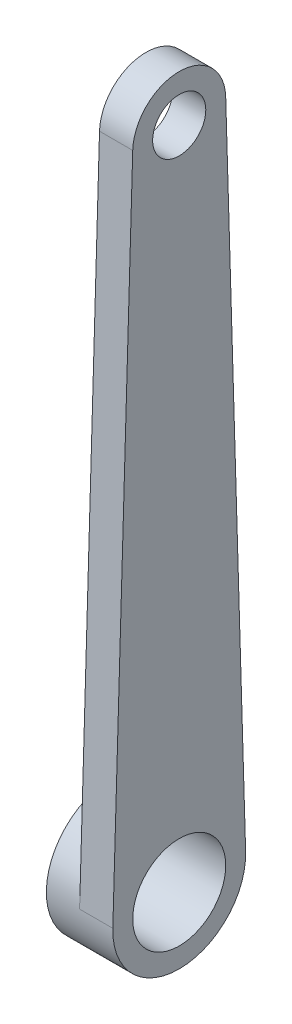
ISO-10303-21;
HEADER;
FILE_DESCRIPTION(('STEP AP214'),'2;1');
FILE_NAME('part.step','',(''),(''),'','','');
FILE_SCHEMA(('AUTOMOTIVE_DESIGN { 1 0 10303 214 1 1 1 1 }'));
ENDSEC;
DATA;
#1=APPLICATION_CONTEXT('core data for automotive mechanical design processes');
#2=APPLICATION_PROTOCOL_DEFINITION('international standard','automotive_design',2000,#1);
#3=PRODUCT_CONTEXT('',#1,'mechanical');
#4=PRODUCT('Part','Part','',(#3));
#5=PRODUCT_RELATED_PRODUCT_CATEGORY('part','',(#4));
#6=PRODUCT_DEFINITION_FORMATION('','',#4);
#7=PRODUCT_DEFINITION_CONTEXT('part definition',#1,'design');
#8=PRODUCT_DEFINITION('design','',#6,#7);
#9=PRODUCT_DEFINITION_SHAPE('','',#8);
#10=(LENGTH_UNIT() NAMED_UNIT(*) SI_UNIT(.MILLI.,.METRE.));
#11=(NAMED_UNIT(*) PLANE_ANGLE_UNIT() SI_UNIT($,.RADIAN.));
#12=(NAMED_UNIT(*) SI_UNIT($,.STERADIAN.) SOLID_ANGLE_UNIT());
#13=UNCERTAINTY_MEASURE_WITH_UNIT(LENGTH_MEASURE(1.E-05),#10,'distance_accuracy_value','');
#14=(GEOMETRIC_REPRESENTATION_CONTEXT(3) GLOBAL_UNCERTAINTY_ASSIGNED_CONTEXT((#13)) GLOBAL_UNIT_ASSIGNED_CONTEXT((#10,
#11,#12)) REPRESENTATION_CONTEXT('',''));
#15=CARTESIAN_POINT('',(0.,0.,0.));
#16=DIRECTION('',(0.,0.,1.));
#17=DIRECTION('',(1.,0.,0.));
#18=AXIS2_PLACEMENT_3D('',#15,#16,#17);
#19=CARTESIAN_POINT('',(0.,0.,0.));
#20=DIRECTION('',(1.,0.,0.));
#21=DIRECTION('',(0.,0.,-1.));
#22=AXIS2_PLACEMENT_3D('',#19,#20,#21);
#23=PLANE('',#22);
#24=CARTESIAN_POINT('',(0.,0.,0.));
#25=DIRECTION('',(1.,0.,0.));
#26=DIRECTION('',(0.,0.,-1.));
#27=AXIS2_PLACEMENT_3D('',#24,#25,#26);
#28=CIRCLE('',#27,10.);
#29=CARTESIAN_POINT('',(0.,0.,-10.));
#30=VERTEX_POINT('',#29);
#31=EDGE_CURVE('E91',#30,#30,#28,.T.);
#32=ORIENTED_EDGE('',*,*,#31,.T.);
#33=EDGE_LOOP('',(#32));
#34=FACE_BOUND('',#33,.T.);
#35=CARTESIAN_POINT('',(0.,-250.,0.));
#36=DIRECTION('',(1.,0.,0.));
#37=DIRECTION('',(0.,0.,-1.));
#38=AXIS2_PLACEMENT_3D('',#35,#36,#37);
#39=CIRCLE('',#38,25.);
#40=CARTESIAN_POINT('',(0.,-249.25,24.9887474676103));
#41=VERTEX_POINT('',#40);
#42=CARTESIAN_POINT('',(0.,-249.25,-24.9887474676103));
#43=VERTEX_POINT('',#42);
#44=EDGE_CURVE('E97',#41,#43,#39,.F.);
#45=ORIENTED_EDGE('',*,*,#44,.F.);
#46=DIRECTION('',(0.,-0.999549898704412,0.03));
#47=VECTOR('',#46,1.);
#48=CARTESIAN_POINT('',(0.,0.525,17.4921232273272));
#49=LINE('',#48,#47);
#50=CARTESIAN_POINT('',(0.,0.525000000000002,17.4921232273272));
#51=VERTEX_POINT('',#50);
#52=EDGE_CURVE('E84',#51,#41,#49,.T.);
#53=ORIENTED_EDGE('',*,*,#52,.F.);
#54=CARTESIAN_POINT('',(0.,0.,0.));
#55=DIRECTION('',(1.,0.,0.));
#56=DIRECTION('',(0.,0.,-1.));
#57=AXIS2_PLACEMENT_3D('',#54,#55,#56);
#58=CIRCLE('',#57,17.5);
#59=CARTESIAN_POINT('',(0.,0.524999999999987,-17.4921232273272));
#60=VERTEX_POINT('',#59);
#61=EDGE_CURVE('E72',#60,#51,#58,.T.);
#62=ORIENTED_EDGE('',*,*,#61,.F.);
#63=DIRECTION('',(0.,-0.999549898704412,-0.03));
#64=VECTOR('',#63,1.);
#65=CARTESIAN_POINT('',(0.,0.525,-17.4921232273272));
#66=LINE('',#65,#64);
#67=EDGE_CURVE('E90',#60,#43,#66,.T.);
#68=ORIENTED_EDGE('',*,*,#67,.T.);
#69=EDGE_LOOP('',(#45,#53,#62,#68));
#70=FACE_BOUND('',#69,.T.);
#71=ADVANCED_FACE('F38',(#34,#70),#23,.F.);
#72=CARTESIAN_POINT('',(12.5,0.525,17.4921232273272));
#73=DIRECTION('',(0.,-0.03,-0.999549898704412));
#74=DIRECTION('',(0.,0.999549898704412,-0.03));
#75=AXIS2_PLACEMENT_3D('',#72,#73,#74);
#76=PLANE('',#75);
#77=ORIENTED_EDGE('',*,*,#52,.T.);
#78=DIRECTION('',(-1.,0.,0.));
#79=VECTOR('',#78,1.);
#80=CARTESIAN_POINT('',(12.5,-249.25,24.9887474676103));
#81=LINE('',#80,#79);
#82=CARTESIAN_POINT('',(12.5,-249.25,24.9887474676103));
#83=VERTEX_POINT('',#82);
#84=EDGE_CURVE('E11',#83,#41,#81,.T.);
#85=ORIENTED_EDGE('',*,*,#84,.F.);
#86=DIRECTION('',(0.,-0.999549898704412,0.03));
#87=VECTOR('',#86,1.);
#88=CARTESIAN_POINT('',(12.5,0.525,17.4921232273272));
#89=LINE('',#88,#87);
#90=CARTESIAN_POINT('',(12.5,0.525000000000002,17.4921232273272));
#91=VERTEX_POINT('',#90);
#92=EDGE_CURVE('E77',#91,#83,#89,.T.);
#93=ORIENTED_EDGE('',*,*,#92,.F.);
#94=DIRECTION('',(-1.,0.,0.));
#95=VECTOR('',#94,1.);
#96=CARTESIAN_POINT('',(12.5,0.525000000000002,17.4921232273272));
#97=LINE('',#96,#95);
#98=EDGE_CURVE('E87',#91,#51,#97,.T.);
#99=ORIENTED_EDGE('',*,*,#98,.T.);
#100=EDGE_LOOP('',(#77,#85,#93,#99));
#101=FACE_BOUND('',#100,.T.);
#102=ADVANCED_FACE('F85',(#101),#76,.F.);
#103=CARTESIAN_POINT('',(12.5,-250.,0.));
#104=DIRECTION('',(-1.,0.,0.));
#105=DIRECTION('',(0.,0.,1.));
#106=AXIS2_PLACEMENT_3D('',#103,#104,#105);
#107=CYLINDRICAL_SURFACE('',#106,25.);
#108=ORIENTED_EDGE('',*,*,#84,.T.);
#109=ORIENTED_EDGE('',*,*,#44,.T.);
#110=DIRECTION('',(-1.,0.,0.));
#111=VECTOR('',#110,1.);
#112=CARTESIAN_POINT('',(12.5,-249.25,-24.9887474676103));
#113=LINE('',#112,#111);
#114=CARTESIAN_POINT('',(12.5,-249.25,-24.9887474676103));
#115=VERTEX_POINT('',#114);
#116=EDGE_CURVE('E47',#115,#43,#113,.T.);
#117=ORIENTED_EDGE('',*,*,#116,.F.);
#118=CARTESIAN_POINT('',(12.5,-250.,0.));
#119=DIRECTION('',(1.,0.,0.));
#120=DIRECTION('',(0.,0.,-1.));
#121=AXIS2_PLACEMENT_3D('',#118,#119,#120);
#122=CIRCLE('',#121,25.);
#123=EDGE_CURVE('E98',#115,#83,#122,.F.);
#124=ORIENTED_EDGE('',*,*,#123,.T.);
#125=EDGE_LOOP('',(#108,#109,#117,#124));
#126=FACE_BOUND('',#125,.T.);
#127=CARTESIAN_POINT('',(-12.5,-250.,0.));
#128=DIRECTION('',(1.,0.,0.));
#129=DIRECTION('',(0.,0.,-1.));
#130=AXIS2_PLACEMENT_3D('',#127,#128,#129);
#131=CIRCLE('',#130,25.);
#132=CARTESIAN_POINT('',(-12.5,-250.,-25.));
#133=VERTEX_POINT('',#132);
#134=EDGE_CURVE('E101',#133,#133,#131,.F.);
#135=ORIENTED_EDGE('',*,*,#134,.F.);
#136=EDGE_LOOP('',(#135));
#137=FACE_BOUND('',#136,.T.);
#138=ADVANCED_FACE('F95',(#126,#137),#107,.T.);
#139=CARTESIAN_POINT('',(12.5,0.525,-17.4921232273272));
#140=DIRECTION('',(0.,0.03,-0.999549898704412));
#141=DIRECTION('',(0.,0.999549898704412,0.03));
#142=AXIS2_PLACEMENT_3D('',#139,#140,#141);
#143=PLANE('',#142);
#144=ORIENTED_EDGE('',*,*,#67,.F.);
#145=DIRECTION('',(-1.,0.,0.));
#146=VECTOR('',#145,1.);
#147=CARTESIAN_POINT('',(12.5,0.524999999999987,-17.4921232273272));
#148=LINE('',#147,#146);
#149=CARTESIAN_POINT('',(12.5,0.524999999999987,-17.4921232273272));
#150=VERTEX_POINT('',#149);
#151=EDGE_CURVE('E69',#150,#60,#148,.T.);
#152=ORIENTED_EDGE('',*,*,#151,.F.);
#153=DIRECTION('',(0.,-0.999549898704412,-0.03));
#154=VECTOR('',#153,1.);
#155=CARTESIAN_POINT('',(12.5,0.525,-17.4921232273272));
#156=LINE('',#155,#154);
#157=EDGE_CURVE('E113',#150,#115,#156,.T.);
#158=ORIENTED_EDGE('',*,*,#157,.T.);
#159=ORIENTED_EDGE('',*,*,#116,.T.);
#160=EDGE_LOOP('',(#144,#152,#158,#159));
#161=FACE_BOUND('',#160,.T.);
#162=ADVANCED_FACE('F126',(#161),#143,.T.);
#163=CARTESIAN_POINT('',(12.5,0.,0.));
#164=DIRECTION('',(-1.,0.,0.));
#165=DIRECTION('',(0.,0.,1.));
#166=AXIS2_PLACEMENT_3D('',#163,#164,#165);
#167=CYLINDRICAL_SURFACE('',#166,17.5);
#168=ORIENTED_EDGE('',*,*,#61,.T.);
#169=ORIENTED_EDGE('',*,*,#98,.F.);
#170=CARTESIAN_POINT('',(12.5,0.,0.));
#171=DIRECTION('',(1.,0.,0.));
#172=DIRECTION('',(0.,0.,-1.));
#173=AXIS2_PLACEMENT_3D('',#170,#171,#172);
#174=CIRCLE('',#173,17.5);
#175=EDGE_CURVE('E55',#150,#91,#174,.T.);
#176=ORIENTED_EDGE('',*,*,#175,.F.);
#177=ORIENTED_EDGE('',*,*,#151,.T.);
#178=EDGE_LOOP('',(#168,#169,#176,#177));
#179=FACE_BOUND('',#178,.T.);
#180=ADVANCED_FACE('F154',(#179),#167,.T.);
#181=CARTESIAN_POINT('',(12.5,0.,0.));
#182=DIRECTION('',(-1.,0.,0.));
#183=DIRECTION('',(0.,0.,1.));
#184=AXIS2_PLACEMENT_3D('',#181,#182,#183);
#185=CYLINDRICAL_SURFACE('',#184,10.);
#186=CARTESIAN_POINT('',(12.5,0.,0.));
#187=DIRECTION('',(1.,0.,0.));
#188=DIRECTION('',(0.,0.,-1.));
#189=AXIS2_PLACEMENT_3D('',#186,#187,#188);
#190=CIRCLE('',#189,10.);
#191=CARTESIAN_POINT('',(12.5,0.,-10.));
#192=VERTEX_POINT('',#191);
#193=EDGE_CURVE('E108',#192,#192,#190,.T.);
#194=ORIENTED_EDGE('',*,*,#193,.T.);
#195=EDGE_LOOP('',(#194));
#196=FACE_BOUND('',#195,.T.);
#197=ORIENTED_EDGE('',*,*,#31,.F.);
#198=EDGE_LOOP('',(#197));
#199=FACE_BOUND('',#198,.T.);
#200=ADVANCED_FACE('F40',(#196,#199),#185,.F.);
#201=CARTESIAN_POINT('',(12.5,-250.,0.));
#202=DIRECTION('',(-1.,0.,0.));
#203=DIRECTION('',(0.,0.,1.));
#204=AXIS2_PLACEMENT_3D('',#201,#202,#203);
#205=CYLINDRICAL_SURFACE('',#204,17.5);
#206=CARTESIAN_POINT('',(12.5,-250.,0.));
#207=DIRECTION('',(1.,0.,0.));
#208=DIRECTION('',(0.,0.,-1.));
#209=AXIS2_PLACEMENT_3D('',#206,#207,#208);
#210=CIRCLE('',#209,17.5);
#211=CARTESIAN_POINT('',(12.5,-250.,-17.5));
#212=VERTEX_POINT('',#211);
#213=EDGE_CURVE('E117',#212,#212,#210,.T.);
#214=ORIENTED_EDGE('',*,*,#213,.T.);
#215=EDGE_LOOP('',(#214));
#216=FACE_BOUND('',#215,.T.);
#217=CARTESIAN_POINT('',(-12.5,-250.,0.));
#218=DIRECTION('',(1.,0.,0.));
#219=DIRECTION('',(0.,0.,-1.));
#220=AXIS2_PLACEMENT_3D('',#217,#218,#219);
#221=CIRCLE('',#220,17.5);
#222=CARTESIAN_POINT('',(-12.5,-250.,-17.5));
#223=VERTEX_POINT('',#222);
#224=EDGE_CURVE('E104',#223,#223,#221,.T.);
#225=ORIENTED_EDGE('',*,*,#224,.F.);
#226=EDGE_LOOP('',(#225));
#227=FACE_BOUND('',#226,.T.);
#228=ADVANCED_FACE('F131',(#216,#227),#205,.F.);
#229=CARTESIAN_POINT('',(12.5,0.,0.));
#230=DIRECTION('',(1.,0.,0.));
#231=DIRECTION('',(0.,0.,-1.));
#232=AXIS2_PLACEMENT_3D('',#229,#230,#231);
#233=PLANE('',#232);
#234=ORIENTED_EDGE('',*,*,#193,.F.);
#235=EDGE_LOOP('',(#234));
#236=FACE_BOUND('',#235,.T.);
#237=ORIENTED_EDGE('',*,*,#92,.T.);
#238=ORIENTED_EDGE('',*,*,#123,.F.);
#239=ORIENTED_EDGE('',*,*,#157,.F.);
#240=ORIENTED_EDGE('',*,*,#175,.T.);
#241=EDGE_LOOP('',(#237,#238,#239,#240));
#242=FACE_BOUND('',#241,.T.);
#243=ORIENTED_EDGE('',*,*,#213,.F.);
#244=EDGE_LOOP('',(#243));
#245=FACE_BOUND('',#244,.T.);
#246=ADVANCED_FACE('F127',(#236,#242,#245),#233,.T.);
#247=CARTESIAN_POINT('',(-12.5,0.,0.));
#248=DIRECTION('',(1.,0.,0.));
#249=DIRECTION('',(0.,0.,-1.));
#250=AXIS2_PLACEMENT_3D('',#247,#248,#249);
#251=PLANE('',#250);
#252=ORIENTED_EDGE('',*,*,#134,.T.);
#253=EDGE_LOOP('',(#252));
#254=FACE_BOUND('',#253,.T.);
#255=ORIENTED_EDGE('',*,*,#224,.T.);
#256=EDGE_LOOP('',(#255));
#257=FACE_BOUND('',#256,.T.);
#258=ADVANCED_FACE('F130',(#254,#257),#251,.F.);
#259=CLOSED_SHELL('',(#71,#102,#138,#162,#180,#200,#228,#246,#258));
#260=MANIFOLD_SOLID_BREP('B2',#259);
#261=ADVANCED_BREP_SHAPE_REPRESENTATION('',(#18,#260),#14);
#262=SHAPE_DEFINITION_REPRESENTATION(#9,#261);
ENDSEC;
END-ISO-10303-21;
